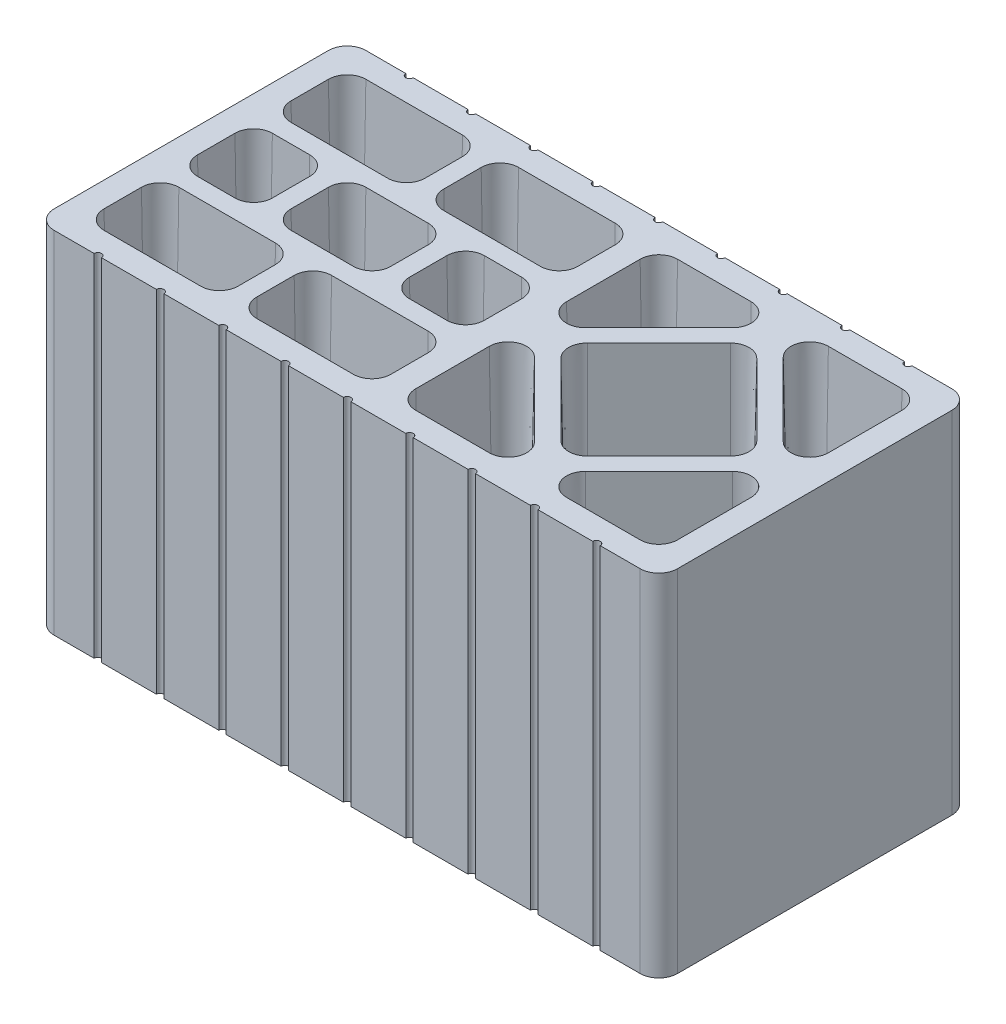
from build123d import *

# Parameters (mm, degrees)
BOSS_EXTRU_1_DEPTH = 28.125
D_POUILLE1_ANGLE   = 1


with BuildPart() as part:
    # Esquisse1 → Boss.-Extru.1 (new body)
    with BuildSketch(Plane(origin=(0, 0, 0), x_dir=(1, 0, 0), z_dir=(0, 1, 0))):
        with BuildLine():
            Line((1.5, 0), (4.7, 0))
            ThreePointArc((4.7, 0), (5, 0.3), (5.3, 0))
            Line((5.3, 0), (9.7, 0))
            ThreePointArc((9.7, 0), (10, 0.3), (10.3, 0))
            Line((10.3, 0), (14.7, 0))
            ThreePointArc((14.7, 0), (15, 0.3), (15.3, 0))
            Line((15.3, 0), (19.7, 0))
            ThreePointArc((19.7, 0), (20, 0.3), (20.3, 0))
            Line((20.3, 0), (24.7, 0))
            ThreePointArc((24.7, 0), (25, 0.3), (25.3, 0))
            Line((25.3, 0), (29.7, 0))
            ThreePointArc((29.7, 0), (30, 0.3), (30.3, 0))
            Line((30.3, 0), (34.7, 0))
            ThreePointArc((34.7, 0), (35, 0.3), (35.3, 0))
            Line((35.3, 0), (39.7, 0))
            ThreePointArc((39.7, 0), (40, 0.3), (40.3, 0))
            Line((40.3, 0), (44.7, 0))
            ThreePointArc((44.7, 0), (45, 0.3), (45.3, 0))
            Line((45.3, 0), (48.5, 0))
            ThreePointArc((48.5, 0), (49.560660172, 0.439339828), (50, 1.5))
            Line((50, 1.5), (50, 23.5))
            ThreePointArc((50, 23.5), (49.560660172, 24.560660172), (48.5, 25))
            Line((48.5, 25), (45.3, 25))
            ThreePointArc((45.3, 25), (45, 24.7), (44.7, 25))
            Line((44.7, 25), (40.3, 25))
            ThreePointArc((40.3, 25), (40, 24.7), (39.7, 25))
            Line((39.7, 25), (35.3, 25))
            ThreePointArc((35.3, 25), (35, 24.7), (34.7, 25))
            Line((34.7, 25), (30.3, 25))
            ThreePointArc((30.3, 25), (30, 24.7), (29.7, 25))
            Line((29.7, 25), (25.3, 25))
            ThreePointArc((25.3, 25), (25, 24.7), (24.7, 25))
            Line((24.7, 25), (20.3, 25))
            ThreePointArc((20.3, 25), (20, 24.7), (19.7, 25))
            Line((19.7, 25), (15.3, 25))
            ThreePointArc((15.3, 25), (15, 24.7), (14.7, 25))
            Line((14.7, 25), (10.3, 25))
            ThreePointArc((10.3, 25), (10, 24.7), (9.7, 25))
            Line((9.7, 25), (5.3, 25))
            ThreePointArc((5.3, 25), (5, 24.7), (4.7, 25))
            Line((4.7, 25), (1.5, 25))
            ThreePointArc((1.5, 25), (0.439339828, 24.560660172), (0, 23.5))
            Line((0, 23.5), (0, 1.5))
            ThreePointArc((0, 1.5), (0.439339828, 0.439339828), (1.5, 0))
        make_face()
        with BuildLine():
            Line((3.5, 8), (11.25, 8))
            ThreePointArc((11.25, 8), (12.310660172, 7.560660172), (12.75, 6.5))
            Line((12.75, 6.5), (12.75, 3.5))
            ThreePointArc((12.75, 3.5), (12.310660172, 2.439339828), (11.25, 2))
            Line((11.25, 2), (3.5, 2))
            ThreePointArc((3.5, 2), (2.439339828, 2.439339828), (2, 3.5))
            Line((2, 3.5), (2, 6.5))
            ThreePointArc((2, 6.5), (2.439339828, 7.560660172), (3.5, 8))
        make_face(mode=Mode.SUBTRACT)
        with BuildLine():
            Line((15.75, 8), (23.5, 8))
            ThreePointArc((23.5, 8), (24.560660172, 7.560660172), (25, 6.5))
            Line((25, 6.5), (25, 3.5))
            ThreePointArc((25, 3.5), (24.560660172, 2.439339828), (23.5, 2))
            Line((23.5, 2), (15.75, 2))
            ThreePointArc((15.75, 2), (14.689339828, 2.439339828), (14.25, 3.5))
            Line((14.25, 3.5), (14.25, 6.5))
            ThreePointArc((14.25, 6.5), (14.689339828, 7.560660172), (15.75, 8))
        make_face(mode=Mode.SUBTRACT)
        with BuildLine():
            Line((2, 14), (2, 11))
            ThreePointArc((2, 11), (2.439339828, 9.939339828), (3.5, 9.5))
            Line((3.5, 9.5), (6.5, 9.5))
            ThreePointArc((6.5, 9.5), (7.560660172, 9.939339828), (8, 11))
            Line((8, 11), (8, 14))
            ThreePointArc((8, 14), (7.560660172, 15.060660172), (6.5, 15.5))
            Line((6.5, 15.5), (3.5, 15.5))
            ThreePointArc((3.5, 15.5), (2.439339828, 15.060660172), (2, 14))
        make_face(mode=Mode.SUBTRACT)
        with BuildLine():
            Line((40.600505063, 2), (46.5, 2))
            ThreePointArc((46.5, 2), (47.560660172, 2.439339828), (48, 3.5))
            Line((48, 3.5), (48, 9.399494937))
            ThreePointArc((48, 9.399494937), (47.074025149, 10.785314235), (45.439339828, 10.460155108))
            Line((45.439339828, 10.460155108), (39.539844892, 4.560660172))
            ThreePointArc((39.539844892, 4.560660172), (39.214685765, 2.925974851), (40.600505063, 2))
        make_face(mode=Mode.SUBTRACT)
        with BuildLine():
            Line((39.539844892, 20.439339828), (45.439339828, 14.539844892))
            ThreePointArc((45.439339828, 14.539844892), (47.074025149, 14.214685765), (48, 15.600505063))
            Line((48, 15.600505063), (48, 21.5))
            ThreePointArc((48, 21.5), (47.560660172, 22.560660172), (46.5, 23))
            Line((46.5, 23), (40.600505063, 23))
            ThreePointArc((40.600505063, 23), (39.214685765, 22.074025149), (39.539844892, 20.439339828))
        make_face(mode=Mode.SUBTRACT)
        with BuildLine():
            Line((9.5, 14), (9.5, 11))
            ThreePointArc((9.5, 11), (9.939339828, 9.939339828), (11, 9.5))
            Line((11, 9.5), (16, 9.5))
            ThreePointArc((16, 9.5), (17.060660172, 9.939339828), (17.5, 11))
            Line((17.5, 11), (17.5, 14))
            ThreePointArc((17.5, 14), (17.060660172, 15.060660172), (16, 15.5))
            Line((16, 15.5), (11, 15.5))
            ThreePointArc((11, 15.5), (9.939339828, 15.060660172), (9.5, 14))
        make_face(mode=Mode.SUBTRACT)
        with BuildLine():
            Line((19, 11), (19, 14))
            ThreePointArc((19, 14), (19.439339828, 15.060660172), (20.5, 15.5))
            Line((20.5, 15.5), (23.5, 15.5))
            ThreePointArc((23.5, 15.5), (24.560660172, 15.060660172), (25, 14))
            Line((25, 14), (25, 11))
            ThreePointArc((25, 11), (24.560660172, 9.939339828), (23.5, 9.5))
            Line((23.5, 9.5), (20.5, 9.5))
            ThreePointArc((20.5, 9.5), (19.439339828, 9.939339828), (19, 11))
        make_face(mode=Mode.SUBTRACT)
        with BuildLine():
            Line((35.460155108, 4.560660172), (29.560660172, 10.460155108))
            ThreePointArc((29.560660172, 10.460155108), (27.925974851, 10.785314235), (27, 9.399494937))
            Line((27, 9.399494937), (27, 3.5))
            ThreePointArc((27, 3.5), (27.439339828, 2.439339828), (28.5, 2))
            Line((28.5, 2), (34.399494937, 2))
            ThreePointArc((34.399494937, 2), (35.785314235, 2.925974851), (35.460155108, 4.560660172))
        make_face(mode=Mode.SUBTRACT)
        with BuildLine():
            Line((25, 18.5), (25, 21.5))
            ThreePointArc((25, 21.5), (24.560660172, 22.560660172), (23.5, 23))
            Line((23.5, 23), (15.75, 23))
            ThreePointArc((15.75, 23), (14.689339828, 22.560660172), (14.25, 21.5))
            Line((14.25, 21.5), (14.25, 18.5))
            ThreePointArc((14.25, 18.5), (14.689339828, 17.439339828), (15.75, 17))
            Line((15.75, 17), (23.5, 17))
            ThreePointArc((23.5, 17), (24.560660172, 17.439339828), (25, 18.5))
        make_face(mode=Mode.SUBTRACT)
        with BuildLine():
            Line((12.75, 18.5), (12.75, 21.5))
            ThreePointArc((12.75, 21.5), (12.310660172, 22.560660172), (11.25, 23))
            Line((11.25, 23), (3.5, 23))
            ThreePointArc((3.5, 23), (2.439339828, 22.560660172), (2, 21.5))
            Line((2, 21.5), (2, 18.5))
            ThreePointArc((2, 18.5), (2.439339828, 17.439339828), (3.5, 17))
            Line((3.5, 17), (11.25, 17))
            ThreePointArc((11.25, 17), (12.310660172, 17.439339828), (12.75, 18.5))
        make_face(mode=Mode.SUBTRACT)
        with BuildLine():
            Line((35.460155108, 20.439339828), (29.560660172, 14.539844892))
            ThreePointArc((29.560660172, 14.539844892), (27.925974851, 14.214685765), (27, 15.600505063))
            Line((27, 15.600505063), (27, 21.5))
            ThreePointArc((27, 21.5), (27.439339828, 22.560660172), (28.5, 23))
            Line((28.5, 23), (34.399494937, 23))
            ThreePointArc((34.399494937, 23), (35.785314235, 22.074025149), (35.460155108, 20.439339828))
        make_face(mode=Mode.SUBTRACT)
        with BuildLine():
            Line((38.560660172, 5.702795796), (44.297204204, 11.439339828))
            ThreePointArc((44.297204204, 11.439339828), (44.736544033, 12.5), (44.297204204, 13.560660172))
            Line((44.297204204, 13.560660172), (38.560660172, 19.297204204))
            ThreePointArc((38.560660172, 19.297204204), (37.5, 19.736544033), (36.439339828, 19.297204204))
            Line((36.439339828, 19.297204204), (30.702795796, 13.560660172))
            ThreePointArc((30.702795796, 13.560660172), (30.263455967, 12.5), (30.702795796, 11.439339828))
            Line((30.702795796, 11.439339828), (36.439339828, 5.702795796))
            ThreePointArc((36.439339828, 5.702795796), (37.5, 5.263455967), (38.560660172, 5.702795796))
        make_face(mode=Mode.SUBTRACT)
    extrude(amount=BOSS_EXTRU_1_DEPTH)

    # D_pouille1
    d_pouille1_faces = [part.faces().sort_by_distance(p)[0] for p in [
        (48, 14.0625, -18.550252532),
        (27.439339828, 14.0625, -22.560660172),
        (31.449747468, 14.0625, -23),
        (35.785314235, 14.0625, -22.074025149),
        (47.074025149, 14.0625, -10.785314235),
        (47.560660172, 14.0625, -22.560660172),
        (43.550252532, 14.0625, -23),
        (37.5, 14.0625, -19.736544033),
        (32.51040764, 14.0625, -7.51040764),
        (27.925974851, 14.0625, -10.785314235),
        (24.560660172, 14.0625, -7.560660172),
        (19.439339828, 14.0625, -15.060660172),
        (24.560660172, 14.0625, -15.060660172),
        (24.560660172, 14.0625, -22.560660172),
        (14.689339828, 14.0625, -22.560660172),
        (17.060660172, 14.0625, -15.060660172),
        (14.689339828, 14.0625, -7.560660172),
        (12.310660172, 14.0625, -7.560660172),
        (7.560660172, 14.0625, -15.060660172),
        (9.939339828, 14.0625, -15.060660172),
        (12.310660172, 14.0625, -22.560660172),
        (2.439339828, 14.0625, -22.560660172),
        (2.439339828, 14.0625, -15.060660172),
        (2.439339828, 14.0625, -7.560660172),
        (2.439339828, 14.0625, -17.439339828),
        (12.310660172, 14.0625, -17.439339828),
        (7.560660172, 14.0625, -9.939339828),
        (2.439339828, 14.0625, -9.939339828),
        (2.439339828, 14.0625, -2.439339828),
        (12.310660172, 14.0625, -2.439339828),
        (9.939339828, 14.0625, -9.939339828),
        (14.689339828, 14.0625, -2.439339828),
        (17.060660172, 14.0625, -9.939339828),
        (14.689339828, 14.0625, -17.439339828),
        (24.560660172, 14.0625, -17.439339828),
        (19.439339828, 14.0625, -9.939339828),
        (24.560660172, 14.0625, -2.439339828),
        (24.560660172, 14.0625, -9.939339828),
        (32.51040764, 14.0625, -17.48959236),
        (27, 14.0625, -18.550252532),
        (27.925974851, 14.0625, -14.214685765),
        (27, 14.0625, -6.449747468),
        (27.439339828, 14.0625, -2.439339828),
        (31.449747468, 14.0625, -2),
        (35.785314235, 14.0625, -2.925974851),
        (30.263455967, 14.0625, -12.5),
        (37.5, 14.0625, -5.263455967),
        (39.214685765, 14.0625, -22.074025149),
        (42.48959236, 14.0625, -17.48959236),
        (47.074025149, 14.0625, -14.214685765),
        (44.736544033, 14.0625, -12.5),
        (47.560660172, 14.0625, -2.439339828),
        (39.214685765, 14.0625, -2.925974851),
        (43.550252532, 14.0625, -2),
        (22, 14.0625, -9.5),
        (19, 14.0625, -12.5),
        (13.5, 14.0625, -9.5),
        (9.5, 14.0625, -12.5),
        (5, 14.0625, -9.5),
        (2, 14.0625, -12.5),
        (2, 14.0625, -5),
        (7.375, 14.0625, -2),
        (14.25, 14.0625, -5),
        (19.625, 14.0625, -2),
        (42.48959236, 14.0625, -7.51040764),
        (33.571067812, 14.0625, -8.571067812),
        (33.571067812, 14.0625, -16.428932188),
        (19.625, 14.0625, -17),
        (14.25, 14.0625, -20),
        (7.375, 14.0625, -17),
        (2, 14.0625, -20),
        (41.428932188, 14.0625, -16.428932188),
        (41.428932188, 14.0625, -8.571067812),
        (48, 14.0625, -6.449747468),
        (25, 14.0625, -5),
        (12.75, 14.0625, -5),
        (19.625, 14.0625, -8),
        (7.375, 14.0625, -8),
        (25, 14.0625, -12.5),
        (22, 14.0625, -15.5),
        (17.5, 14.0625, -12.5),
        (13.5, 14.0625, -15.5),
        (8, 14.0625, -12.5),
        (5, 14.0625, -15.5),
        (25, 14.0625, -20),
        (19.625, 14.0625, -23),
        (7.375, 14.0625, -23),
        (12.75, 14.0625, -20),
    ]]
    draft(d_pouille1_faces, Plane(origin=(40, 28.125, -25), x_dir=(0, 0, 1), z_dir=(0, 1, 0)), D_POUILLE1_ANGLE)


solid = part.part
